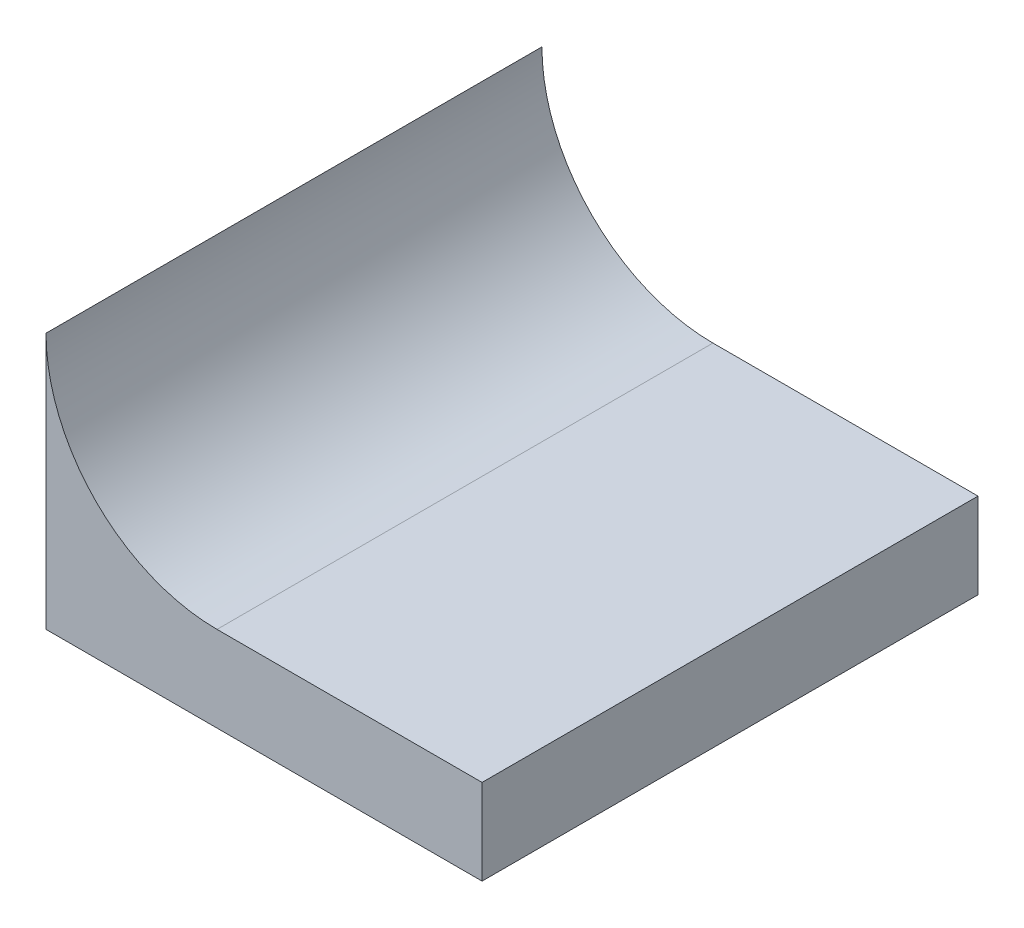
from build123d import *

# Parameters (mm, degrees)
BOSS_EXTRUDE1_DEPTH = 0.29


with BuildPart() as part:
    # Sketch1 → Boss-Extrude1 (new, symmetric)
    with BuildSketch(Plane.XY):
        with BuildLine():
            Line((0, 0), (0.51, 0))
            Line((0.51, 0), (0.51, 0.1))
            Line((0.51, 0.1), (0.2, 0.1))
            ThreePointArc((0.2, 0.1), (0.058578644, 0.158578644), (0, 0.3))
            Line((0, 0.3), (0, 0))
        make_face()
    extrude(amount=BOSS_EXTRUDE1_DEPTH, both=True)


solid = part.part
